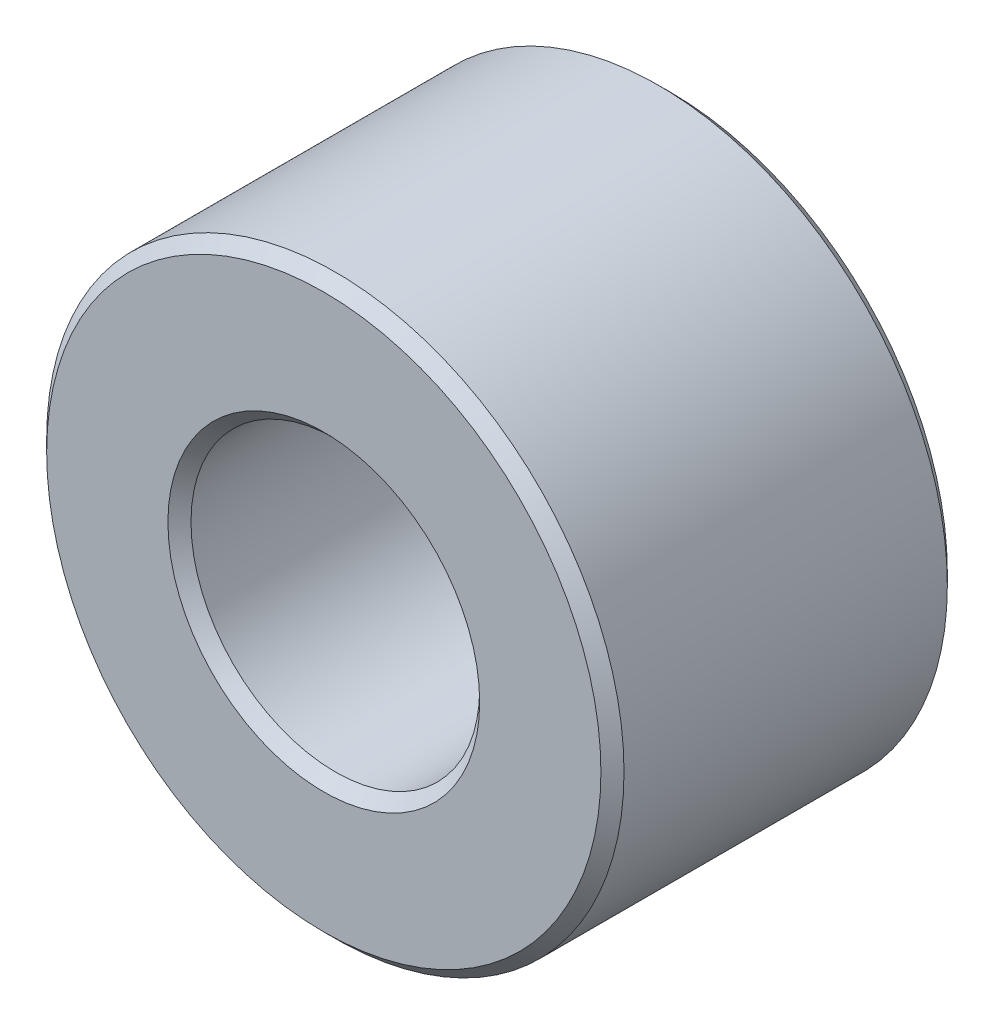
ISO-10303-21;
HEADER;
FILE_DESCRIPTION(('STEP AP214'),'2;1');
FILE_NAME('part.step','',(''),(''),'','','');
FILE_SCHEMA(('AUTOMOTIVE_DESIGN { 1 0 10303 214 1 1 1 1 }'));
ENDSEC;
DATA;
#1=APPLICATION_CONTEXT('core data for automotive mechanical design processes');
#2=APPLICATION_PROTOCOL_DEFINITION('international standard','automotive_design',2000,#1);
#3=PRODUCT_CONTEXT('',#1,'mechanical');
#4=PRODUCT('Part','Part','',(#3));
#5=PRODUCT_RELATED_PRODUCT_CATEGORY('part','',(#4));
#6=PRODUCT_DEFINITION_FORMATION('','',#4);
#7=PRODUCT_DEFINITION_CONTEXT('part definition',#1,'design');
#8=PRODUCT_DEFINITION('design','',#6,#7);
#9=PRODUCT_DEFINITION_SHAPE('','',#8);
#10=(LENGTH_UNIT() NAMED_UNIT(*) SI_UNIT(.MILLI.,.METRE.));
#11=(NAMED_UNIT(*) PLANE_ANGLE_UNIT() SI_UNIT($,.RADIAN.));
#12=(NAMED_UNIT(*) SI_UNIT($,.STERADIAN.) SOLID_ANGLE_UNIT());
#13=UNCERTAINTY_MEASURE_WITH_UNIT(LENGTH_MEASURE(1.E-05),#10,'distance_accuracy_value','');
#14=(GEOMETRIC_REPRESENTATION_CONTEXT(3) GLOBAL_UNCERTAINTY_ASSIGNED_CONTEXT((#13)) GLOBAL_UNIT_ASSIGNED_CONTEXT((#10,
#11,#12)) REPRESENTATION_CONTEXT('',''));
#15=CARTESIAN_POINT('',(0.,0.,0.));
#16=DIRECTION('',(0.,0.,1.));
#17=DIRECTION('',(1.,0.,0.));
#18=AXIS2_PLACEMENT_3D('',#15,#16,#17);
#19=CARTESIAN_POINT('',(0.,0.,1.5));
#20=DIRECTION('',(0.,0.,1.));
#21=DIRECTION('',(1.,0.,0.));
#22=AXIS2_PLACEMENT_3D('',#19,#20,#21);
#23=PLANE('',#22);
#24=CARTESIAN_POINT('',(0.,0.,1.5));
#25=DIRECTION('',(0.,0.,1.));
#26=DIRECTION('',(1.,0.,0.));
#27=AXIS2_PLACEMENT_3D('',#24,#25,#26);
#28=CIRCLE('',#27,1.35);
#29=CARTESIAN_POINT('',(1.35,0.,1.5));
#30=VERTEX_POINT('',#29);
#31=EDGE_CURVE('E10',#30,#30,#28,.F.);
#32=ORIENTED_EDGE('',*,*,#31,.T.);
#33=EDGE_LOOP('',(#32));
#34=FACE_BOUND('',#33,.T.);
#35=CARTESIAN_POINT('',(0.,0.,1.5));
#36=DIRECTION('',(0.,0.,1.));
#37=DIRECTION('',(1.,0.,0.));
#38=AXIS2_PLACEMENT_3D('',#35,#36,#37);
#39=CIRCLE('',#38,2.4);
#40=CARTESIAN_POINT('',(2.4,0.,1.5));
#41=VERTEX_POINT('',#40);
#42=EDGE_CURVE('E45',#41,#41,#39,.T.);
#43=ORIENTED_EDGE('',*,*,#42,.T.);
#44=EDGE_LOOP('',(#43));
#45=FACE_BOUND('',#44,.T.);
#46=ADVANCED_FACE('F37',(#34,#45),#23,.T.);
#47=CARTESIAN_POINT('',(0.,0.,-1.5));
#48=DIRECTION('',(0.,0.,1.));
#49=DIRECTION('',(1.,0.,0.));
#50=AXIS2_PLACEMENT_3D('',#47,#48,#49);
#51=PLANE('',#50);
#52=CARTESIAN_POINT('',(0.,0.,-1.5));
#53=DIRECTION('',(0.,0.,1.));
#54=DIRECTION('',(1.,0.,0.));
#55=AXIS2_PLACEMENT_3D('',#52,#53,#54);
#56=CIRCLE('',#55,2.4);
#57=CARTESIAN_POINT('',(2.4,0.,-1.5));
#58=VERTEX_POINT('',#57);
#59=EDGE_CURVE('E63',#58,#58,#56,.F.);
#60=ORIENTED_EDGE('',*,*,#59,.T.);
#61=EDGE_LOOP('',(#60));
#62=FACE_BOUND('',#61,.T.);
#63=CARTESIAN_POINT('',(0.,0.,-1.5));
#64=DIRECTION('',(0.,0.,1.));
#65=DIRECTION('',(1.,0.,0.));
#66=AXIS2_PLACEMENT_3D('',#63,#64,#65);
#67=CIRCLE('',#66,1.35);
#68=CARTESIAN_POINT('',(-1.35,0.,-1.5));
#69=VERTEX_POINT('',#68);
#70=EDGE_CURVE('E66',#69,#69,#67,.T.);
#71=ORIENTED_EDGE('',*,*,#70,.T.);
#72=EDGE_LOOP('',(#71));
#73=FACE_BOUND('',#72,.T.);
#74=ADVANCED_FACE('F89',(#62,#73),#51,.F.);
#75=CARTESIAN_POINT('',(0.,0.,1.5));
#76=DIRECTION('',(0.,0.,-1.));
#77=DIRECTION('',(-1.,0.,0.));
#78=AXIS2_PLACEMENT_3D('',#75,#76,#77);
#79=CYLINDRICAL_SURFACE('',#78,2.5);
#80=CARTESIAN_POINT('',(0.,0.,-1.4));
#81=DIRECTION('',(0.,0.,1.));
#82=DIRECTION('',(1.,0.,0.));
#83=AXIS2_PLACEMENT_3D('',#80,#81,#82);
#84=CIRCLE('',#83,2.5);
#85=CARTESIAN_POINT('',(2.5,0.,-1.4));
#86=VERTEX_POINT('',#85);
#87=EDGE_CURVE('E69',#86,#86,#84,.T.);
#88=ORIENTED_EDGE('',*,*,#87,.T.);
#89=EDGE_LOOP('',(#88));
#90=FACE_BOUND('',#89,.T.);
#91=CARTESIAN_POINT('',(0.,0.,1.4));
#92=DIRECTION('',(0.,0.,1.));
#93=DIRECTION('',(1.,0.,0.));
#94=AXIS2_PLACEMENT_3D('',#91,#92,#93);
#95=CIRCLE('',#94,2.5);
#96=CARTESIAN_POINT('',(2.5,0.,1.4));
#97=VERTEX_POINT('',#96);
#98=EDGE_CURVE('E73',#97,#97,#95,.F.);
#99=ORIENTED_EDGE('',*,*,#98,.T.);
#100=EDGE_LOOP('',(#99));
#101=FACE_BOUND('',#100,.T.);
#102=ADVANCED_FACE('F78',(#90,#101),#79,.T.);
#103=CARTESIAN_POINT('',(0.,0.,1.5));
#104=DIRECTION('',(0.,0.,-1.));
#105=DIRECTION('',(-1.,0.,0.));
#106=AXIS2_PLACEMENT_3D('',#103,#104,#105);
#107=CYLINDRICAL_SURFACE('',#106,1.25);
#108=CARTESIAN_POINT('',(0.,0.,-1.4));
#109=DIRECTION('',(0.,0.,1.));
#110=DIRECTION('',(1.,0.,0.));
#111=AXIS2_PLACEMENT_3D('',#108,#109,#110);
#112=CIRCLE('',#111,1.25);
#113=CARTESIAN_POINT('',(-1.25,0.,-1.4));
#114=VERTEX_POINT('',#113);
#115=EDGE_CURVE('E51',#114,#114,#112,.F.);
#116=ORIENTED_EDGE('',*,*,#115,.T.);
#117=EDGE_LOOP('',(#116));
#118=FACE_BOUND('',#117,.T.);
#119=CARTESIAN_POINT('',(0.,0.,1.4));
#120=DIRECTION('',(0.,0.,1.));
#121=DIRECTION('',(1.,0.,0.));
#122=AXIS2_PLACEMENT_3D('',#119,#120,#121);
#123=CIRCLE('',#122,1.25);
#124=CARTESIAN_POINT('',(1.25,0.,1.4));
#125=VERTEX_POINT('',#124);
#126=EDGE_CURVE('E57',#125,#125,#123,.T.);
#127=ORIENTED_EDGE('',*,*,#126,.T.);
#128=EDGE_LOOP('',(#127));
#129=FACE_BOUND('',#128,.T.);
#130=ADVANCED_FACE('F97',(#118,#129),#107,.F.);
#131=CARTESIAN_POINT('',(0.,0.,-1.4));
#132=DIRECTION('',(0.,0.,1.));
#133=DIRECTION('',(1.,0.,0.));
#134=AXIS2_PLACEMENT_3D('',#131,#132,#133);
#135=CONICAL_SURFACE('',#134,2.5,0.785398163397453);
#136=ORIENTED_EDGE('',*,*,#59,.F.);
#137=EDGE_LOOP('',(#136));
#138=FACE_BOUND('',#137,.T.);
#139=ORIENTED_EDGE('',*,*,#87,.F.);
#140=EDGE_LOOP('',(#139));
#141=FACE_BOUND('',#140,.T.);
#142=ADVANCED_FACE('F102',(#138,#141),#135,.T.);
#143=CARTESIAN_POINT('',(0.,0.,-1.5));
#144=DIRECTION('',(0.,0.,-1.));
#145=DIRECTION('',(-1.,0.,0.));
#146=AXIS2_PLACEMENT_3D('',#143,#144,#145);
#147=CONICAL_SURFACE('',#146,1.35,0.785398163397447);
#148=CARTESIAN_POINT('',(-1.25,0.,-1.4));
#149=CARTESIAN_POINT('',(-1.25104166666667,0.,-1.40104166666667));
#150=CARTESIAN_POINT('',(-1.25208333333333,0.,-1.40208333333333));
#151=CARTESIAN_POINT('',(-1.25416666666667,0.,-1.40416666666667));
#152=CARTESIAN_POINT('',(-1.25520833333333,0.,-1.40520833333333));
#153=CARTESIAN_POINT('',(-1.25729166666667,0.,-1.40729166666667));
#154=CARTESIAN_POINT('',(-1.25833333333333,0.,-1.40833333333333));
#155=CARTESIAN_POINT('',(-1.26041666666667,0.,-1.41041666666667));
#156=CARTESIAN_POINT('',(-1.26145833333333,0.,-1.41145833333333));
#157=CARTESIAN_POINT('',(-1.26354166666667,0.,-1.41354166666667));
#158=CARTESIAN_POINT('',(-1.26458333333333,0.,-1.41458333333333));
#159=CARTESIAN_POINT('',(-1.26666666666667,0.,-1.41666666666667));
#160=CARTESIAN_POINT('',(-1.26770833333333,0.,-1.41770833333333));
#161=CARTESIAN_POINT('',(-1.26979166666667,0.,-1.41979166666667));
#162=CARTESIAN_POINT('',(-1.27083333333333,0.,-1.42083333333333));
#163=CARTESIAN_POINT('',(-1.27291666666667,0.,-1.42291666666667));
#164=CARTESIAN_POINT('',(-1.27395833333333,0.,-1.42395833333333));
#165=CARTESIAN_POINT('',(-1.27604166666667,0.,-1.42604166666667));
#166=CARTESIAN_POINT('',(-1.27708333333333,0.,-1.42708333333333));
#167=CARTESIAN_POINT('',(-1.27916666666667,0.,-1.42916666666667));
#168=CARTESIAN_POINT('',(-1.28020833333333,0.,-1.43020833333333));
#169=CARTESIAN_POINT('',(-1.28229166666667,0.,-1.43229166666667));
#170=CARTESIAN_POINT('',(-1.28333333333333,0.,-1.43333333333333));
#171=CARTESIAN_POINT('',(-1.28541666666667,0.,-1.43541666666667));
#172=CARTESIAN_POINT('',(-1.28645833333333,0.,-1.43645833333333));
#173=CARTESIAN_POINT('',(-1.28854166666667,0.,-1.43854166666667));
#174=CARTESIAN_POINT('',(-1.28958333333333,0.,-1.43958333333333));
#175=CARTESIAN_POINT('',(-1.29166666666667,0.,-1.44166666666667));
#176=CARTESIAN_POINT('',(-1.29270833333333,0.,-1.44270833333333));
#177=CARTESIAN_POINT('',(-1.29479166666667,0.,-1.44479166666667));
#178=CARTESIAN_POINT('',(-1.29583333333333,0.,-1.44583333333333));
#179=CARTESIAN_POINT('',(-1.29791666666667,0.,-1.44791666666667));
#180=CARTESIAN_POINT('',(-1.29895833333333,0.,-1.44895833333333));
#181=CARTESIAN_POINT('',(-1.30104166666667,0.,-1.45104166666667));
#182=CARTESIAN_POINT('',(-1.30208333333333,0.,-1.45208333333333));
#183=CARTESIAN_POINT('',(-1.30416666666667,0.,-1.45416666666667));
#184=CARTESIAN_POINT('',(-1.30520833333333,0.,-1.45520833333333));
#185=CARTESIAN_POINT('',(-1.30729166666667,0.,-1.45729166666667));
#186=CARTESIAN_POINT('',(-1.30833333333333,0.,-1.45833333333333));
#187=CARTESIAN_POINT('',(-1.31041666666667,0.,-1.46041666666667));
#188=CARTESIAN_POINT('',(-1.31145833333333,0.,-1.46145833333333));
#189=CARTESIAN_POINT('',(-1.31354166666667,0.,-1.46354166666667));
#190=CARTESIAN_POINT('',(-1.31458333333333,0.,-1.46458333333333));
#191=CARTESIAN_POINT('',(-1.31666666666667,0.,-1.46666666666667));
#192=CARTESIAN_POINT('',(-1.31770833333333,0.,-1.46770833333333));
#193=CARTESIAN_POINT('',(-1.31979166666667,0.,-1.46979166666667));
#194=CARTESIAN_POINT('',(-1.32083333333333,0.,-1.47083333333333));
#195=CARTESIAN_POINT('',(-1.32291666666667,0.,-1.47291666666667));
#196=CARTESIAN_POINT('',(-1.32395833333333,0.,-1.47395833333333));
#197=CARTESIAN_POINT('',(-1.32604166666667,0.,-1.47604166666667));
#198=CARTESIAN_POINT('',(-1.32708333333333,0.,-1.47708333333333));
#199=CARTESIAN_POINT('',(-1.32916666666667,0.,-1.47916666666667));
#200=CARTESIAN_POINT('',(-1.33020833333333,0.,-1.48020833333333));
#201=CARTESIAN_POINT('',(-1.33229166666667,0.,-1.48229166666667));
#202=CARTESIAN_POINT('',(-1.33333333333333,0.,-1.48333333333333));
#203=CARTESIAN_POINT('',(-1.33541666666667,0.,-1.48541666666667));
#204=CARTESIAN_POINT('',(-1.33645833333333,0.,-1.48645833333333));
#205=CARTESIAN_POINT('',(-1.33854166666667,0.,-1.48854166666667));
#206=CARTESIAN_POINT('',(-1.33958333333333,0.,-1.48958333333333));
#207=CARTESIAN_POINT('',(-1.34166666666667,0.,-1.49166666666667));
#208=CARTESIAN_POINT('',(-1.34270833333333,0.,-1.49270833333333));
#209=CARTESIAN_POINT('',(-1.34479166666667,0.,-1.49479166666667));
#210=CARTESIAN_POINT('',(-1.34583333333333,0.,-1.49583333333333));
#211=CARTESIAN_POINT('',(-1.34791666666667,0.,-1.49791666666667));
#212=CARTESIAN_POINT('',(-1.34895833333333,0.,-1.49895833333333));
#213=CARTESIAN_POINT('',(-1.35,0.,-1.5));
#214=B_SPLINE_CURVE_WITH_KNOTS('',3,(#148,#149,#150,#151,#152,#153,#154,#155,#156,#157,#158,
#159,#160,#161,#162,#163,#164,#165,#166,#167,#168,#169,#170,#171,#172,#173,#174,#175,#176,#177,
#178,#179,#180,#181,#182,#183,#184,#185,#186,#187,#188,#189,#190,#191,#192,#193,#194,#195,#196,
#197,#198,#199,#200,#201,#202,#203,#204,#205,#206,#207,#208,#209,#210,#211,#212,#213),
.UNSPECIFIED.,.F.,.F.,(4,2,2,2,2,2,2,2,2,2,2,2,2,2,2,2,2,2,2,2,2,2,2,2,2,2,2,2,2,2,2,2,4),(0.,
0.00441941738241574,0.00883883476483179,0.0132582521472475,0.0176776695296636,
0.0220970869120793,0.0265165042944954,0.0309359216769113,0.0353553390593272,0.0397747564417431,
0.0441941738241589,0.0486135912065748,0.0530330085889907,0.0574524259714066,0.0618718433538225,
0.0662912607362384,0.0707106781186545,0.0751300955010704,0.0795495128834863,0.0839689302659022,
0.0883883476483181,0.092807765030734,0.0972271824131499,0.101646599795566,0.106066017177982,
0.110485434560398,0.114904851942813,0.11932426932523,0.123743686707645,0.128163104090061,
0.132582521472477,0.137001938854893,0.141421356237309),.UNSPECIFIED.);
#215=EDGE_CURVE('BSEAM86',#114,#69,#214,.T.);
#216=ORIENTED_EDGE('',*,*,#115,.F.);
#217=ORIENTED_EDGE('',*,*,#70,.F.);
#218=ORIENTED_EDGE('',*,*,#215,.T.);
#219=ORIENTED_EDGE('',*,*,#215,.F.);
#220=EDGE_LOOP('',(#216,#218,#217,#219));
#221=FACE_BOUND('',#220,.T.);
#222=ADVANCED_FACE('F86',(#221),#147,.F.);
#223=CARTESIAN_POINT('',(0.,0.,1.4));
#224=DIRECTION('',(0.,0.,1.));
#225=DIRECTION('',(1.,0.,0.));
#226=AXIS2_PLACEMENT_3D('',#223,#224,#225);
#227=CONICAL_SURFACE('',#226,1.25,0.785398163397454);
#228=ORIENTED_EDGE('',*,*,#31,.F.);
#229=EDGE_LOOP('',(#228));
#230=FACE_BOUND('',#229,.T.);
#231=ORIENTED_EDGE('',*,*,#126,.F.);
#232=EDGE_LOOP('',(#231));
#233=FACE_BOUND('',#232,.T.);
#234=ADVANCED_FACE('F82',(#230,#233),#227,.F.);
#235=CARTESIAN_POINT('',(0.,0.,1.5));
#236=DIRECTION('',(0.,0.,-1.));
#237=DIRECTION('',(-1.,0.,0.));
#238=AXIS2_PLACEMENT_3D('',#235,#236,#237);
#239=CONICAL_SURFACE('',#238,2.4,0.78539816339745);
#240=ORIENTED_EDGE('',*,*,#98,.F.);
#241=EDGE_LOOP('',(#240));
#242=FACE_BOUND('',#241,.T.);
#243=ORIENTED_EDGE('',*,*,#42,.F.);
#244=EDGE_LOOP('',(#243));
#245=FACE_BOUND('',#244,.T.);
#246=ADVANCED_FACE('F39',(#242,#245),#239,.T.);
#247=CLOSED_SHELL('',(#46,#74,#102,#130,#142,#222,#234,#246));
#248=MANIFOLD_SOLID_BREP('B2',#247);
#249=ADVANCED_BREP_SHAPE_REPRESENTATION('',(#18,#248),#14);
#250=SHAPE_DEFINITION_REPRESENTATION(#9,#249);
ENDSEC;
END-ISO-10303-21;
